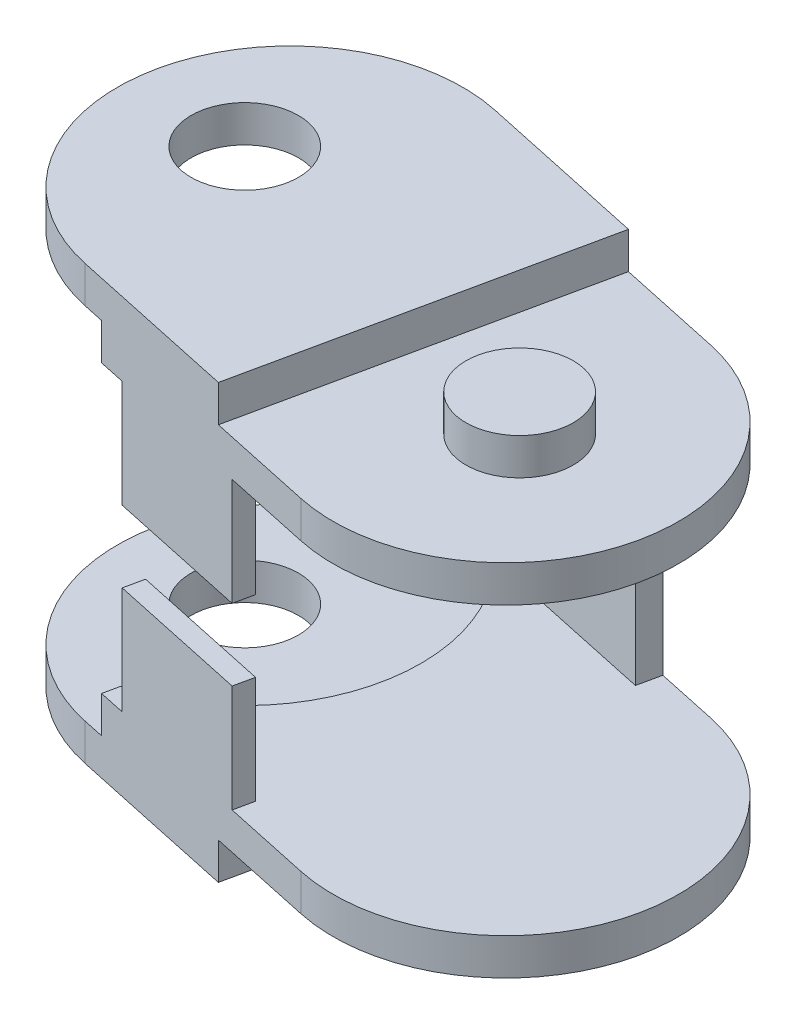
ISO-10303-21;
HEADER;
FILE_DESCRIPTION(('STEP AP214'),'2;1');
FILE_NAME('part.step','',(''),(''),'','','');
FILE_SCHEMA(('AUTOMOTIVE_DESIGN { 1 0 10303 214 1 1 1 1 }'));
ENDSEC;
DATA;
#1=APPLICATION_CONTEXT('core data for automotive mechanical design processes');
#2=APPLICATION_PROTOCOL_DEFINITION('international standard','automotive_design',2000,#1);
#3=PRODUCT_CONTEXT('',#1,'mechanical');
#4=PRODUCT('Part','Part','',(#3));
#5=PRODUCT_RELATED_PRODUCT_CATEGORY('part','',(#4));
#6=PRODUCT_DEFINITION_FORMATION('','',#4);
#7=PRODUCT_DEFINITION_CONTEXT('part definition',#1,'design');
#8=PRODUCT_DEFINITION('design','',#6,#7);
#9=PRODUCT_DEFINITION_SHAPE('','',#8);
#10=(LENGTH_UNIT() NAMED_UNIT(*) SI_UNIT(.MILLI.,.METRE.));
#11=(NAMED_UNIT(*) PLANE_ANGLE_UNIT() SI_UNIT($,.RADIAN.));
#12=(NAMED_UNIT(*) SI_UNIT($,.STERADIAN.) SOLID_ANGLE_UNIT());
#13=UNCERTAINTY_MEASURE_WITH_UNIT(LENGTH_MEASURE(1.E-05),#10,'distance_accuracy_value','');
#14=(GEOMETRIC_REPRESENTATION_CONTEXT(3) GLOBAL_UNCERTAINTY_ASSIGNED_CONTEXT((#13)) GLOBAL_UNIT_ASSIGNED_CONTEXT((#10,
#11,#12)) REPRESENTATION_CONTEXT('',''));
#15=CARTESIAN_POINT('',(0.,0.,0.));
#16=DIRECTION('',(0.,0.,1.));
#17=DIRECTION('',(1.,0.,0.));
#18=AXIS2_PLACEMENT_3D('',#15,#16,#17);
#19=CARTESIAN_POINT('',(-534.686032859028,6.,62.8004896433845));
#20=DIRECTION('',(0.,-1.,0.));
#21=DIRECTION('',(0.,0.,-1.));
#22=AXIS2_PLACEMENT_3D('',#19,#20,#21);
#23=PLANE('',#22);
#24=DIRECTION('',(0.977762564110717,0.,0.2097149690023));
#25=VECTOR('',#24,1.);
#26=CARTESIAN_POINT('',(-534.570689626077,6.,62.2627202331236));
#27=LINE('',#26,#25);
#28=CARTESIAN_POINT('',(-530.659639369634,6.,63.1015801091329));
#29=VERTEX_POINT('',#28);
#30=CARTESIAN_POINT('',(-538.48173988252,6.,61.4238603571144));
#31=VERTEX_POINT('',#30);
#32=EDGE_CURVE('E313',#29,#31,#27,.F.);
#33=ORIENTED_EDGE('',*,*,#32,.T.);
#34=DIRECTION('',(0.2097149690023,0.,-0.977762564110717));
#35=VECTOR('',#34,1.);
#36=CARTESIAN_POINT('',(-538.597083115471,6.,61.9616297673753));
#37=LINE('',#36,#35);
#38=CARTESIAN_POINT('',(-538.712426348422,6.,62.4993991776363));
#39=VERTEX_POINT('',#38);
#40=EDGE_CURVE('E291',#31,#39,#37,.F.);
#41=ORIENTED_EDGE('',*,*,#40,.T.);
#42=DIRECTION('',(0.977762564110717,0.,0.2097149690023));
#43=VECTOR('',#42,1.);
#44=CARTESIAN_POINT('',(-533.676949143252,6.,63.5794312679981));
#45=LINE('',#44,#43);
#46=CARTESIAN_POINT('',(-530.890325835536,6.,64.1771189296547));
#47=VERTEX_POINT('',#46);
#48=EDGE_CURVE('E238',#47,#39,#45,.F.);
#49=ORIENTED_EDGE('',*,*,#48,.F.);
#50=DIRECTION('',(-0.2097149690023,0.,0.977762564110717));
#51=VECTOR('',#50,1.);
#52=CARTESIAN_POINT('',(-530.774982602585,6.,63.6393495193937));
#53=LINE('',#52,#51);
#54=EDGE_CURVE('E262',#47,#29,#53,.F.);
#55=ORIENTED_EDGE('',*,*,#54,.T.);
#56=EDGE_LOOP('',(#33,#41,#49,#55));
#57=FACE_BOUND('',#56,.T.);
#58=ADVANCED_FACE('F17',(#57),#23,.F.);
#59=CARTESIAN_POINT('',(-538.597083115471,8.,61.9616297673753));
#60=DIRECTION('',(0.977762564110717,0.,0.2097149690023));
#61=DIRECTION('',(0.2097149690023,0.,-0.977762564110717));
#62=AXIS2_PLACEMENT_3D('',#59,#60,#61);
#63=PLANE('',#62);
#64=DIRECTION('',(0.,1.,0.));
#65=VECTOR('',#64,1.);
#66=CARTESIAN_POINT('',(-538.48173988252,8.,61.4238603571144));
#67=LINE('',#66,#65);
#68=CARTESIAN_POINT('',(-538.48173988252,0.,61.4238603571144));
#69=VERTEX_POINT('',#68);
#70=EDGE_CURVE('E314',#31,#69,#67,.F.);
#71=ORIENTED_EDGE('',*,*,#70,.T.);
#72=DIRECTION('',(0.2097149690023,0.,-0.977762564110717));
#73=VECTOR('',#72,1.);
#74=CARTESIAN_POINT('',(-538.597083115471,0.,61.9616297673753));
#75=LINE('',#74,#73);
#76=CARTESIAN_POINT('',(-538.712426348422,0.,62.4993991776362));
#77=VERTEX_POINT('',#76);
#78=EDGE_CURVE('E301',#77,#69,#75,.T.);
#79=ORIENTED_EDGE('',*,*,#78,.F.);
#80=DIRECTION('',(0.,1.,0.));
#81=VECTOR('',#80,1.);
#82=CARTESIAN_POINT('',(-538.712426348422,20.1,62.4993991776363));
#83=LINE('',#82,#81);
#84=EDGE_CURVE('E282',#39,#77,#83,.F.);
#85=ORIENTED_EDGE('',*,*,#84,.F.);
#86=ORIENTED_EDGE('',*,*,#40,.F.);
#87=EDGE_LOOP('',(#71,#79,#85,#86));
#88=FACE_BOUND('',#87,.T.);
#89=ADVANCED_FACE('F925',(#88),#63,.F.);
#90=CARTESIAN_POINT('',(-538.155320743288,8.,52.7494179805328));
#91=DIRECTION('',(-0.977762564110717,0.,-0.2097149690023));
#92=DIRECTION('',(-0.2097149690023,0.,0.977762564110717));
#93=AXIS2_PLACEMENT_3D('',#90,#91,#92);
#94=PLANE('',#93);
#95=DIRECTION('',(0.,1.,0.));
#96=VECTOR('',#95,1.);
#97=CARTESIAN_POINT('',(-540.179070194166,20.1,62.1848267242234));
#98=LINE('',#97,#96);
#99=CARTESIAN_POINT('',(-540.179070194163,0.,62.1848267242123));
#100=VERTEX_POINT('',#99);
#101=CARTESIAN_POINT('',(-540.179070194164,-2.05,62.184826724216));
#102=VERTEX_POINT('',#101);
#103=EDGE_CURVE('E269',#100,#102,#98,.F.);
#104=ORIENTED_EDGE('',*,*,#103,.F.);
#105=DIRECTION('',(-0.2097149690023,0.,0.977762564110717));
#106=VECTOR('',#105,1.);
#107=CARTESIAN_POINT('',(-538.155320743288,0.,52.7494179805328));
#108=LINE('',#107,#106);
#109=CARTESIAN_POINT('',(-539.992841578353,0.,61.316565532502));
#110=VERTEX_POINT('',#109);
#111=EDGE_CURVE('E274',#100,#110,#108,.F.);
#112=ORIENTED_EDGE('',*,*,#111,.T.);
#113=DIRECTION('',(0.,-1.,0.));
#114=VECTOR('',#113,1.);
#115=CARTESIAN_POINT('',(-539.992841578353,-1.025,61.3165655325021));
#116=LINE('',#115,#114);
#117=CARTESIAN_POINT('',(-539.992841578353,-2.05,61.3165655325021));
#118=VERTEX_POINT('',#117);
#119=EDGE_CURVE('E239',#110,#118,#116,.T.);
#120=ORIENTED_EDGE('',*,*,#119,.T.);
#121=DIRECTION('',(-0.20971496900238,0.,0.9777625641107));
#122=VECTOR('',#121,1.);
#123=CARTESIAN_POINT('',(-539.992841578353,-2.05,61.3165655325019));
#124=LINE('',#123,#122);
#125=EDGE_CURVE('E227',#118,#102,#124,.T.);
#126=ORIENTED_EDGE('',*,*,#125,.T.);
#127=EDGE_LOOP('',(#104,#112,#120,#126));
#128=FACE_BOUND('',#127,.T.);
#129=ADVANCED_FACE('F916',(#128),#94,.T.);
#130=CARTESIAN_POINT('',(-530.774982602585,8.,63.6393495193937));
#131=DIRECTION('',(-0.977762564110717,0.,-0.2097149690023));
#132=DIRECTION('',(-0.2097149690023,0.,0.977762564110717));
#133=AXIS2_PLACEMENT_3D('',#130,#131,#132);
#134=PLANE('',#133);
#135=DIRECTION('',(0.,1.,0.));
#136=VECTOR('',#135,1.);
#137=CARTESIAN_POINT('',(-530.890325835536,20.1,64.1771189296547));
#138=LINE('',#137,#136);
#139=CARTESIAN_POINT('',(-530.890325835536,0.,64.1771189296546));
#140=VERTEX_POINT('',#139);
#141=EDGE_CURVE('E268',#140,#47,#138,.T.);
#142=ORIENTED_EDGE('',*,*,#141,.F.);
#143=DIRECTION('',(-0.2097149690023,0.,0.977762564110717));
#144=VECTOR('',#143,1.);
#145=CARTESIAN_POINT('',(-530.774982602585,0.,63.6393495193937));
#146=LINE('',#145,#144);
#147=CARTESIAN_POINT('',(-530.659639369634,0.,63.1015801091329));
#148=VERTEX_POINT('',#147);
#149=EDGE_CURVE('E272',#148,#140,#146,.T.);
#150=ORIENTED_EDGE('',*,*,#149,.F.);
#151=DIRECTION('',(0.,1.,0.));
#152=VECTOR('',#151,1.);
#153=CARTESIAN_POINT('',(-530.659639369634,8.,63.1015801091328));
#154=LINE('',#153,#152);
#155=EDGE_CURVE('E310',#148,#29,#154,.T.);
#156=ORIENTED_EDGE('',*,*,#155,.T.);
#157=ORIENTED_EDGE('',*,*,#54,.F.);
#158=EDGE_LOOP('',(#142,#150,#156,#157));
#159=FACE_BOUND('',#158,.T.);
#160=ADVANCED_FACE('F907',(#159),#134,.F.);
#161=CARTESIAN_POINT('',(-523.000001,-4.1,56.));
#162=DIRECTION('',(0.,-1.,0.));
#163=DIRECTION('',(0.,0.,-1.));
#164=AXIS2_PLACEMENT_3D('',#161,#162,#163);
#165=PLANE('',#164);
#166=CARTESIAN_POINT('',(-523.000001,-4.1,56.));
#167=DIRECTION('',(0.,-1.,0.));
#168=DIRECTION('',(0.,0.,-1.));
#169=AXIS2_PLACEMENT_3D('',#166,#167,#168);
#170=CIRCLE('',#169,2.99999999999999);
#171=CARTESIAN_POINT('',(-523.000001,-4.1,53.));
#172=VERTEX_POINT('',#171);
#173=EDGE_CURVE('E395',#172,#172,#170,.F.);
#174=ORIENTED_EDGE('',*,*,#173,.F.);
#175=EDGE_LOOP('',(#174));
#176=FACE_BOUND('',#175,.T.);
#177=ADVANCED_FACE('F898',(#176),#165,.T.);
#178=CARTESIAN_POINT('',(-523.000001,20.1,56.));
#179=DIRECTION('',(0.,1.,0.));
#180=DIRECTION('',(0.,0.,1.));
#181=AXIS2_PLACEMENT_3D('',#178,#179,#180);
#182=PLANE('',#181);
#183=CARTESIAN_POINT('',(-523.000001,20.1,56.));
#184=DIRECTION('',(0.,-1.,0.));
#185=DIRECTION('',(0.,0.,-1.));
#186=AXIS2_PLACEMENT_3D('',#183,#184,#185);
#187=CIRCLE('',#186,2.99999999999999);
#188=CARTESIAN_POINT('',(-523.000001,20.1,53.));
#189=VERTEX_POINT('',#188);
#190=EDGE_CURVE('E391',#189,#189,#187,.T.);
#191=ORIENTED_EDGE('',*,*,#190,.F.);
#192=EDGE_LOOP('',(#191));
#193=FACE_BOUND('',#192,.T.);
#194=ADVANCED_FACE('F889',(#193),#182,.T.);
#195=CARTESIAN_POINT('',(-542.555252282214,-3.075,51.805700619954));
#196=DIRECTION('',(0.,-1.,0.));
#197=DIRECTION('',(0.,0.,-1.));
#198=AXIS2_PLACEMENT_3D('',#195,#196,#197);
#199=CYLINDRICAL_SURFACE('',#198,2.99999999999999);
#200=CARTESIAN_POINT('',(-542.555252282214,-4.1,51.805700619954));
#201=DIRECTION('',(0.,-1.,0.));
#202=DIRECTION('',(0.,0.,-1.));
#203=AXIS2_PLACEMENT_3D('',#200,#201,#202);
#204=CIRCLE('',#203,2.99999999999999);
#205=CARTESIAN_POINT('',(-542.555252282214,-4.1,48.805700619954));
#206=VERTEX_POINT('',#205);
#207=EDGE_CURVE('E381',#206,#206,#204,.F.);
#208=ORIENTED_EDGE('',*,*,#207,.F.);
#209=EDGE_LOOP('',(#208));
#210=FACE_BOUND('',#209,.T.);
#211=CARTESIAN_POINT('',(-542.555252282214,-2.05,51.805700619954));
#212=DIRECTION('',(0.,-1.,0.));
#213=DIRECTION('',(0.,0.,-1.));
#214=AXIS2_PLACEMENT_3D('',#211,#212,#213);
#215=CIRCLE('',#214,2.99999999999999);
#216=CARTESIAN_POINT('',(-542.555252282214,-2.05,48.805700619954));
#217=VERTEX_POINT('',#216);
#218=EDGE_CURVE('E20',#217,#217,#215,.F.);
#219=ORIENTED_EDGE('',*,*,#218,.T.);
#220=EDGE_LOOP('',(#219));
#221=FACE_BOUND('',#220,.T.);
#222=ADVANCED_FACE('F880',(#210,#221),#199,.F.);
#223=CARTESIAN_POINT('',(-547.932946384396,-2.05,50.6522682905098));
#224=DIRECTION('',(0.,-1.,0.));
#225=DIRECTION('',(0.,0.,-1.));
#226=AXIS2_PLACEMENT_3D('',#223,#224,#225);
#227=PLANE('',#226);
#228=ORIENTED_EDGE('',*,*,#218,.F.);
#229=EDGE_LOOP('',(#228));
#230=FACE_BOUND('',#229,.T.);
#231=DIRECTION('',(0.977762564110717,0.,0.2097149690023));
#232=VECTOR('',#231,1.);
#233=CARTESIAN_POINT('',(-533.676949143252,-2.05,63.5794312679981));
#234=LINE('',#233,#232);
#235=CARTESIAN_POINT('',(-541.352385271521,-2.05,61.93316876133));
#236=VERTEX_POINT('',#235);
#237=EDGE_CURVE('E265',#102,#236,#234,.F.);
#238=ORIENTED_EDGE('',*,*,#237,.F.);
#239=ORIENTED_EDGE('',*,*,#125,.F.);
#240=CARTESIAN_POINT('',(-542.555252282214,-2.05,51.805700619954));
#241=DIRECTION('',(0.,-1.,0.));
#242=DIRECTION('',(0.,0.,-1.));
#243=AXIS2_PLACEMENT_3D('',#240,#241,#242);
#244=CIRCLE('',#243,9.84999999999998);
#245=CARTESIAN_POINT('',(-536.317799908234,-2.05,44.182270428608));
#246=VERTEX_POINT('',#245);
#247=EDGE_CURVE('E232',#118,#246,#244,.F.);
#248=ORIENTED_EDGE('',*,*,#247,.T.);
#249=DIRECTION('',(-0.209714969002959,0.,0.977762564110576));
#250=VECTOR('',#249,1.);
#251=CARTESIAN_POINT('',(-536.131571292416,-2.05,43.3140092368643));
#252=LINE('',#251,#250);
#253=CARTESIAN_POINT('',(-536.131571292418,-2.05,43.3140092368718));
#254=VERTEX_POINT('',#253);
#255=EDGE_CURVE('E217',#254,#246,#252,.T.);
#256=ORIENTED_EDGE('',*,*,#255,.F.);
#257=DIRECTION('',(0.977762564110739,0.,0.209714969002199));
#258=VECTOR('',#257,1.);
#259=CARTESIAN_POINT('',(-537.304886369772,-2.05,43.0623512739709));
#260=LINE('',#259,#258);
#261=CARTESIAN_POINT('',(-537.304886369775,-2.05,43.0623512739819));
#262=VERTEX_POINT('',#261);
#263=EDGE_CURVE('E228',#262,#254,#260,.T.);
#264=ORIENTED_EDGE('',*,*,#263,.F.);
#265=CARTESIAN_POINT('',(-539.328635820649,-2.05,52.4977600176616));
#266=DIRECTION('',(0.,-1.,0.));
#267=DIRECTION('',(0.,0.,-1.));
#268=AXIS2_PLACEMENT_3D('',#265,#266,#267);
#269=CIRCLE('',#268,9.65000000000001);
#270=EDGE_CURVE('E378',#236,#262,#269,.T.);
#271=ORIENTED_EDGE('',*,*,#270,.F.);
#272=EDGE_LOOP('',(#238,#239,#248,#256,#264,#271));
#273=FACE_BOUND('',#272,.T.);
#274=ADVANCED_FACE('F234',(#230,#273),#227,.F.);
#275=CARTESIAN_POINT('',(-534.570689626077,8.,62.2627202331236));
#276=DIRECTION('',(-0.2097149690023,0.,0.977762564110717));
#277=DIRECTION('',(0.977762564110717,0.,0.2097149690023));
#278=AXIS2_PLACEMENT_3D('',#275,#276,#277);
#279=PLANE('',#278);
#280=ORIENTED_EDGE('',*,*,#155,.F.);
#281=DIRECTION('',(-0.977762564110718,0.,-0.209714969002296));
#282=VECTOR('',#281,1.);
#283=CARTESIAN_POINT('',(-530.659639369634,0.,63.1015801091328));
#284=LINE('',#283,#282);
#285=EDGE_CURVE('E298',#148,#69,#284,.T.);
#286=ORIENTED_EDGE('',*,*,#285,.T.);
#287=ORIENTED_EDGE('',*,*,#70,.F.);
#288=ORIENTED_EDGE('',*,*,#32,.F.);
#289=EDGE_LOOP('',(#280,#286,#287,#288));
#290=FACE_BOUND('',#289,.T.);
#291=ADVANCED_FACE('F864',(#290),#279,.F.);
#292=CARTESIAN_POINT('',(-542.555252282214,-1.025,51.805700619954));
#293=DIRECTION('',(0.,-1.,0.));
#294=DIRECTION('',(0.,0.,-1.));
#295=AXIS2_PLACEMENT_3D('',#292,#293,#294);
#296=CYLINDRICAL_SURFACE('',#295,9.84999999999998);
#297=CARTESIAN_POINT('',(-542.555252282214,0.,51.805700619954));
#298=DIRECTION('',(0.,-1.,0.));
#299=DIRECTION('',(0.,0.,-1.));
#300=AXIS2_PLACEMENT_3D('',#297,#298,#299);
#301=CIRCLE('',#300,9.84999999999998);
#302=CARTESIAN_POINT('',(-535.708127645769,0.,44.7247837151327));
#303=VERTEX_POINT('',#302);
#304=EDGE_CURVE('E297',#110,#303,#301,.F.);
#305=ORIENTED_EDGE('',*,*,#304,.T.);
#306=CARTESIAN_POINT('',(-542.555252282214,0.,51.805700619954));
#307=DIRECTION('',(0.,-1.,0.));
#308=DIRECTION('',(0.,0.,-1.));
#309=AXIS2_PLACEMENT_3D('',#306,#307,#308);
#310=CIRCLE('',#309,9.84999999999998);
#311=CARTESIAN_POINT('',(-536.317799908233,0.,44.1822704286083));
#312=VERTEX_POINT('',#311);
#313=EDGE_CURVE('E242',#303,#312,#310,.F.);
#314=ORIENTED_EDGE('',*,*,#313,.T.);
#315=DIRECTION('',(0.,1.,0.));
#316=VECTOR('',#315,1.);
#317=CARTESIAN_POINT('',(-536.317799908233,8.,44.1822704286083));
#318=LINE('',#317,#316);
#319=EDGE_CURVE('E222',#246,#312,#318,.T.);
#320=ORIENTED_EDGE('',*,*,#319,.F.);
#321=ORIENTED_EDGE('',*,*,#247,.F.);
#322=ORIENTED_EDGE('',*,*,#119,.F.);
#323=EDGE_LOOP('',(#305,#314,#320,#321,#322));
#324=FACE_BOUND('',#323,.T.);
#325=ADVANCED_FACE('F240',(#324),#296,.F.);
#326=CARTESIAN_POINT('',(-533.676949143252,20.1,63.5794312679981));
#327=DIRECTION('',(-0.2097149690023,0.,0.977762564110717));
#328=DIRECTION('',(0.977762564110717,0.,0.2097149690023));
#329=AXIS2_PLACEMENT_3D('',#326,#327,#328);
#330=PLANE('',#329);
#331=DIRECTION('',(-0.977762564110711,0.,-0.209714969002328));
#332=VECTOR('',#331,1.);
#333=CARTESIAN_POINT('',(-526.001513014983,0.,65.2256937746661));
#334=LINE('',#333,#332);
#335=CARTESIAN_POINT('',(-526.001513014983,0.,65.2256937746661));
#336=VERTEX_POINT('',#335);
#337=EDGE_CURVE('E323',#336,#140,#334,.T.);
#338=ORIENTED_EDGE('',*,*,#337,.T.);
#339=ORIENTED_EDGE('',*,*,#141,.T.);
#340=ORIENTED_EDGE('',*,*,#48,.T.);
#341=ORIENTED_EDGE('',*,*,#84,.T.);
#342=DIRECTION('',(-0.977762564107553,0.,-0.209714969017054));
#343=VECTOR('',#342,1.);
#344=CARTESIAN_POINT('',(-538.712426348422,0.,62.4993991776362));
#345=LINE('',#344,#343);
#346=EDGE_CURVE('E294',#77,#100,#345,.T.);
#347=ORIENTED_EDGE('',*,*,#346,.T.);
#348=ORIENTED_EDGE('',*,*,#103,.T.);
#349=ORIENTED_EDGE('',*,*,#237,.T.);
#350=DIRECTION('',(0.,-1.,0.));
#351=VECTOR('',#350,1.);
#352=CARTESIAN_POINT('',(-541.352385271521,20.1,61.93316876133));
#353=LINE('',#352,#351);
#354=CARTESIAN_POINT('',(-541.35238527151,-4.1,61.9331687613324));
#355=VERTEX_POINT('',#354);
#356=EDGE_CURVE('E245',#355,#236,#353,.F.);
#357=ORIENTED_EDGE('',*,*,#356,.F.);
#358=DIRECTION('',(-0.977762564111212,0.,-0.209714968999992));
#359=VECTOR('',#358,1.);
#360=CARTESIAN_POINT('',(-531.868088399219,-4.1,63.9674039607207));
#361=LINE('',#360,#359);
#362=CARTESIAN_POINT('',(-531.868088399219,-4.1,63.9674039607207));
#363=VERTEX_POINT('',#362);
#364=EDGE_CURVE('E384',#363,#355,#361,.T.);
#365=ORIENTED_EDGE('',*,*,#364,.F.);
#366=DIRECTION('',(0.,1.,0.));
#367=VECTOR('',#366,1.);
#368=CARTESIAN_POINT('',(-531.868088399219,-3.075,63.9674039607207));
#369=LINE('',#368,#367);
#370=CARTESIAN_POINT('',(-531.868088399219,-2.05,63.9674039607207));
#371=VERTEX_POINT('',#370);
#372=EDGE_CURVE('E386',#371,#363,#369,.F.);
#373=ORIENTED_EDGE('',*,*,#372,.F.);
#374=DIRECTION('',(-0.977762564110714,0.,-0.209714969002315));
#375=VECTOR('',#374,1.);
#376=CARTESIAN_POINT('',(-526.001513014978,-2.05,65.2256937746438));
#377=LINE('',#376,#375);
#378=CARTESIAN_POINT('',(-526.001513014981,-2.05,65.2256937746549));
#379=VERTEX_POINT('',#378);
#380=EDGE_CURVE('E370',#379,#371,#377,.T.);
#381=ORIENTED_EDGE('',*,*,#380,.F.);
#382=DIRECTION('',(0.,-1.,0.));
#383=VECTOR('',#382,1.);
#384=CARTESIAN_POINT('',(-526.001513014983,20.1,65.2256937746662));
#385=LINE('',#384,#383);
#386=EDGE_CURVE('E371',#336,#379,#385,.T.);
#387=ORIENTED_EDGE('',*,*,#386,.F.);
#388=EDGE_LOOP('',(#338,#339,#340,#341,#347,#348,#349,#357,#365,#373,#381,#387));
#389=FACE_BOUND('',#388,.T.);
#390=ADVANCED_FACE('F510',(#389),#330,.T.);
#391=CARTESIAN_POINT('',(-523.000001,-3.075,56.));
#392=DIRECTION('',(0.,-1.,0.));
#393=DIRECTION('',(0.,0.,-1.));
#394=AXIS2_PLACEMENT_3D('',#391,#392,#393);
#395=CYLINDRICAL_SURFACE('',#394,2.99999999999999);
#396=CARTESIAN_POINT('',(-523.000001,-2.05,56.));
#397=DIRECTION('',(0.,-1.,0.));
#398=DIRECTION('',(0.,0.,-1.));
#399=AXIS2_PLACEMENT_3D('',#396,#397,#398);
#400=CIRCLE('',#399,2.99999999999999);
#401=CARTESIAN_POINT('',(-523.000001,-2.05,53.));
#402=VERTEX_POINT('',#401);
#403=EDGE_CURVE('E363',#402,#402,#400,.F.);
#404=ORIENTED_EDGE('',*,*,#403,.F.);
#405=EDGE_LOOP('',(#404));
#406=FACE_BOUND('',#405,.T.);
#407=ORIENTED_EDGE('',*,*,#173,.T.);
#408=EDGE_LOOP('',(#407));
#409=FACE_BOUND('',#408,.T.);
#410=ADVANCED_FACE('F840',(#406,#409),#395,.T.);
#411=CARTESIAN_POINT('',(-523.000001,19.075,56.));
#412=DIRECTION('',(0.,-1.,0.));
#413=DIRECTION('',(0.,0.,-1.));
#414=AXIS2_PLACEMENT_3D('',#411,#412,#413);
#415=CYLINDRICAL_SURFACE('',#414,2.99999999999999);
#416=ORIENTED_EDGE('',*,*,#190,.T.);
#417=EDGE_LOOP('',(#416));
#418=FACE_BOUND('',#417,.T.);
#419=CARTESIAN_POINT('',(-523.000001,18.05,56.));
#420=DIRECTION('',(0.,-1.,0.));
#421=DIRECTION('',(0.,0.,-1.));
#422=AXIS2_PLACEMENT_3D('',#419,#420,#421);
#423=CIRCLE('',#422,2.99999999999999);
#424=CARTESIAN_POINT('',(-523.000001,18.05,53.));
#425=VERTEX_POINT('',#424);
#426=EDGE_CURVE('E359',#425,#425,#423,.F.);
#427=ORIENTED_EDGE('',*,*,#426,.T.);
#428=EDGE_LOOP('',(#427));
#429=FACE_BOUND('',#428,.T.);
#430=ADVANCED_FACE('F831',(#418,#429),#415,.T.);
#431=CARTESIAN_POINT('',(-542.555252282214,19.075,51.805700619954));
#432=DIRECTION('',(0.,-1.,0.));
#433=DIRECTION('',(0.,0.,-1.));
#434=AXIS2_PLACEMENT_3D('',#431,#432,#433);
#435=CYLINDRICAL_SURFACE('',#434,2.99999999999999);
#436=CARTESIAN_POINT('',(-542.555252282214,18.05,51.805700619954));
#437=DIRECTION('',(0.,-1.,0.));
#438=DIRECTION('',(0.,0.,-1.));
#439=AXIS2_PLACEMENT_3D('',#436,#437,#438);
#440=CIRCLE('',#439,2.99999999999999);
#441=CARTESIAN_POINT('',(-542.555252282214,18.05,48.805700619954));
#442=VERTEX_POINT('',#441);
#443=EDGE_CURVE('E387',#442,#442,#440,.F.);
#444=ORIENTED_EDGE('',*,*,#443,.F.);
#445=EDGE_LOOP('',(#444));
#446=FACE_BOUND('',#445,.T.);
#447=CARTESIAN_POINT('',(-542.555252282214,20.1,51.805700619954));
#448=DIRECTION('',(0.,-1.,0.));
#449=DIRECTION('',(0.,0.,-1.));
#450=AXIS2_PLACEMENT_3D('',#447,#448,#449);
#451=CIRCLE('',#450,2.99999999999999);
#452=CARTESIAN_POINT('',(-542.555252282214,20.1,48.805700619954));
#453=VERTEX_POINT('',#452);
#454=EDGE_CURVE('E355',#453,#453,#451,.F.);
#455=ORIENTED_EDGE('',*,*,#454,.T.);
#456=EDGE_LOOP('',(#455));
#457=FACE_BOUND('',#456,.T.);
#458=ADVANCED_FACE('F822',(#446,#457),#435,.F.);
#459=CARTESIAN_POINT('',(-547.932946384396,18.05,50.6522682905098));
#460=DIRECTION('',(0.,-1.,0.));
#461=DIRECTION('',(0.,0.,-1.));
#462=AXIS2_PLACEMENT_3D('',#459,#460,#461);
#463=PLANE('',#462);
#464=ORIENTED_EDGE('',*,*,#443,.T.);
#465=EDGE_LOOP('',(#464));
#466=FACE_BOUND('',#465,.T.);
#467=DIRECTION('',(-0.2097149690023,0.,0.977762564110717));
#468=VECTOR('',#467,1.);
#469=CARTESIAN_POINT('',(-538.155320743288,18.05,52.7494179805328));
#470=LINE('',#469,#468);
#471=CARTESIAN_POINT('',(-540.179070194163,18.05,62.1848267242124));
#472=VERTEX_POINT('',#471);
#473=CARTESIAN_POINT('',(-539.992841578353,18.05,61.316565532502));
#474=VERTEX_POINT('',#473);
#475=EDGE_CURVE('E466',#472,#474,#470,.F.);
#476=ORIENTED_EDGE('',*,*,#475,.F.);
#477=DIRECTION('',(-0.977762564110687,0.,-0.209714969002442));
#478=VECTOR('',#477,1.);
#479=CARTESIAN_POINT('',(-540.179070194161,18.05,62.1848267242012));
#480=LINE('',#479,#478);
#481=CARTESIAN_POINT('',(-541.352385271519,18.05,61.9331687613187));
#482=VERTEX_POINT('',#481);
#483=EDGE_CURVE('E390',#472,#482,#480,.T.);
#484=ORIENTED_EDGE('',*,*,#483,.T.);
#485=CARTESIAN_POINT('',(-539.328635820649,18.05,52.4977600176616));
#486=DIRECTION('',(0.,-1.,0.));
#487=DIRECTION('',(0.,0.,-1.));
#488=AXIS2_PLACEMENT_3D('',#485,#486,#487);
#489=CIRCLE('',#488,9.65000000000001);
#490=CARTESIAN_POINT('',(-537.304886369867,18.05,43.0623512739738));
#491=VERTEX_POINT('',#490);
#492=EDGE_CURVE('E352',#491,#482,#489,.F.);
#493=ORIENTED_EDGE('',*,*,#492,.F.);
#494=DIRECTION('',(0.977762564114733,0.,0.209714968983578));
#495=VECTOR('',#494,1.);
#496=CARTESIAN_POINT('',(-537.304886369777,18.05,43.0623512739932));
#497=LINE('',#496,#495);
#498=CARTESIAN_POINT('',(-536.131571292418,18.05,43.3140092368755));
#499=VERTEX_POINT('',#498);
#500=EDGE_CURVE('E394',#491,#499,#497,.T.);
#501=ORIENTED_EDGE('',*,*,#500,.T.);
#502=DIRECTION('',(-0.2097149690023,0.,0.977762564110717));
#503=VECTOR('',#502,1.);
#504=CARTESIAN_POINT('',(-538.155320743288,18.05,52.7494179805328));
#505=LINE('',#504,#503);
#506=CARTESIAN_POINT('',(-536.317799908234,18.05,44.182270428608));
#507=VERTEX_POINT('',#506);
#508=EDGE_CURVE('E445',#507,#499,#505,.F.);
#509=ORIENTED_EDGE('',*,*,#508,.F.);
#510=CARTESIAN_POINT('',(-542.555252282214,18.05,51.805700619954));
#511=DIRECTION('',(0.,-1.,0.));
#512=DIRECTION('',(0.,0.,-1.));
#513=AXIS2_PLACEMENT_3D('',#510,#511,#512);
#514=CIRCLE('',#513,9.84999999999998);
#515=EDGE_CURVE('E342',#507,#474,#514,.T.);
#516=ORIENTED_EDGE('',*,*,#515,.T.);
#517=EDGE_LOOP('',(#476,#484,#493,#501,#509,#516));
#518=FACE_BOUND('',#517,.T.);
#519=ADVANCED_FACE('F813',(#466,#518),#463,.T.);
#520=CARTESIAN_POINT('',(-542.555252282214,0.,51.805700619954));
#521=DIRECTION('',(0.,1.,0.));
#522=DIRECTION('',(0.,0.,1.));
#523=AXIS2_PLACEMENT_3D('',#520,#521,#522);
#524=PLANE('',#523);
#525=ORIENTED_EDGE('',*,*,#313,.F.);
#526=DIRECTION('',(-0.977762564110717,0.,-0.2097149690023));
#527=VECTOR('',#526,1.);
#528=CARTESIAN_POINT('',(-531.024535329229,0.,45.7293419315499));
#529=LINE('',#528,#527);
#530=CARTESIAN_POINT('',(-536.402229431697,0.,44.5759096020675));
#531=VERTEX_POINT('',#530);
#532=EDGE_CURVE('E434',#303,#531,#529,.T.);
#533=ORIENTED_EDGE('',*,*,#532,.T.);
#534=DIRECTION('',(-0.2097149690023,0.,0.977762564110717));
#535=VECTOR('',#534,1.);
#536=CARTESIAN_POINT('',(-538.155320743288,0.,52.7494179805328));
#537=LINE('',#536,#535);
#538=EDGE_CURVE('E244',#312,#531,#537,.T.);
#539=ORIENTED_EDGE('',*,*,#538,.F.);
#540=EDGE_LOOP('',(#525,#533,#539));
#541=FACE_BOUND('',#540,.T.);
#542=ADVANCED_FACE('F581',(#541),#524,.F.);
#543=CARTESIAN_POINT('',(-542.555252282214,16.,51.805700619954));
#544=DIRECTION('',(0.,-1.,0.));
#545=DIRECTION('',(0.,0.,-1.));
#546=AXIS2_PLACEMENT_3D('',#543,#544,#545);
#547=PLANE('',#546);
#548=CARTESIAN_POINT('',(-542.555252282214,16.,51.805700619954));
#549=DIRECTION('',(0.,-1.,0.));
#550=DIRECTION('',(0.,0.,-1.));
#551=AXIS2_PLACEMENT_3D('',#548,#549,#550);
#552=CIRCLE('',#551,9.84999999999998);
#553=CARTESIAN_POINT('',(-535.708127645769,16.,44.7247837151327));
#554=VERTEX_POINT('',#553);
#555=CARTESIAN_POINT('',(-536.317799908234,16.,44.182270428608));
#556=VERTEX_POINT('',#555);
#557=EDGE_CURVE('E346',#554,#556,#552,.F.);
#558=ORIENTED_EDGE('',*,*,#557,.T.);
#559=DIRECTION('',(-0.2097149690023,0.,0.977762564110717));
#560=VECTOR('',#559,1.);
#561=CARTESIAN_POINT('',(-538.155320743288,16.,52.7494179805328));
#562=LINE('',#561,#560);
#563=CARTESIAN_POINT('',(-536.402229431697,16.,44.5759096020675));
#564=VERTEX_POINT('',#563);
#565=EDGE_CURVE('E247',#564,#556,#562,.F.);
#566=ORIENTED_EDGE('',*,*,#565,.F.);
#567=DIRECTION('',(-0.977762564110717,0.,-0.2097149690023));
#568=VECTOR('',#567,1.);
#569=CARTESIAN_POINT('',(-531.024535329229,16.,45.7293419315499));
#570=LINE('',#569,#568);
#571=EDGE_CURVE('E440',#564,#554,#570,.F.);
#572=ORIENTED_EDGE('',*,*,#571,.T.);
#573=EDGE_LOOP('',(#558,#566,#572));
#574=FACE_BOUND('',#573,.T.);
#575=ADVANCED_FACE('F572',(#574),#547,.F.);
#576=CARTESIAN_POINT('',(-529.844338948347,-3.075,54.5319952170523));
#577=DIRECTION('',(0.977762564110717,0.,0.2097149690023));
#578=DIRECTION('',(0.2097149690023,0.,-0.977762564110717));
#579=AXIS2_PLACEMENT_3D('',#576,#577,#578);
#580=PLANE('',#579);
#581=DIRECTION('',(0.,1.,0.));
#582=VECTOR('',#581,1.);
#583=CARTESIAN_POINT('',(-527.82058949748,20.1,45.0965864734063));
#584=LINE('',#583,#582);
#585=CARTESIAN_POINT('',(-527.82058949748,-2.05,45.0965864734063));
#586=VERTEX_POINT('',#585);
#587=CARTESIAN_POINT('',(-527.82058949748,-4.1,45.0965864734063));
#588=VERTEX_POINT('',#587);
#589=EDGE_CURVE('E419',#586,#588,#584,.F.);
#590=ORIENTED_EDGE('',*,*,#589,.F.);
#591=DIRECTION('',(0.209714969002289,0.,-0.977762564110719));
#592=VECTOR('',#591,1.);
#593=CARTESIAN_POINT('',(-531.868088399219,-2.05,63.9674039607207));
#594=LINE('',#593,#592);
#595=EDGE_CURVE('E366',#371,#586,#594,.T.);
#596=ORIENTED_EDGE('',*,*,#595,.F.);
#597=ORIENTED_EDGE('',*,*,#372,.T.);
#598=DIRECTION('',(-0.209714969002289,0.,0.977762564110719));
#599=VECTOR('',#598,1.);
#600=CARTESIAN_POINT('',(-527.820589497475,-4.1,45.0965864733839));
#601=LINE('',#600,#599);
#602=EDGE_CURVE('E427',#588,#363,#601,.T.);
#603=ORIENTED_EDGE('',*,*,#602,.F.);
#604=EDGE_LOOP('',(#590,#596,#597,#603));
#605=FACE_BOUND('',#604,.T.);
#606=ADVANCED_FACE('F570',(#605),#580,.T.);
#607=CARTESIAN_POINT('',(-531.65319969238,-4.1,54.1440225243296));
#608=DIRECTION('',(0.,-1.,0.));
#609=DIRECTION('',(0.,0.,-1.));
#610=AXIS2_PLACEMENT_3D('',#607,#608,#609);
#611=PLANE('',#610);
#612=ORIENTED_EDGE('',*,*,#207,.T.);
#613=EDGE_LOOP('',(#612));
#614=FACE_BOUND('',#613,.T.);
#615=CARTESIAN_POINT('',(-539.328635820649,-4.1,52.4977600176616));
#616=DIRECTION('',(0.,-1.,0.));
#617=DIRECTION('',(0.,0.,-1.));
#618=AXIS2_PLACEMENT_3D('',#615,#616,#617);
#619=CIRCLE('',#618,9.65000000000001);
#620=CARTESIAN_POINT('',(-537.304886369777,-4.1,43.0623512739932));
#621=VERTEX_POINT('',#620);
#622=EDGE_CURVE('E250',#621,#355,#619,.F.);
#623=ORIENTED_EDGE('',*,*,#622,.F.);
#624=DIRECTION('',(-0.977762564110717,0.,-0.2097149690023));
#625=VECTOR('',#624,1.);
#626=CARTESIAN_POINT('',(-529.629450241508,-4.1,44.7086137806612));
#627=LINE('',#626,#625);
#628=EDGE_CURVE('E415',#588,#621,#627,.T.);
#629=ORIENTED_EDGE('',*,*,#628,.F.);
#630=ORIENTED_EDGE('',*,*,#602,.T.);
#631=ORIENTED_EDGE('',*,*,#364,.T.);
#632=EDGE_LOOP('',(#623,#629,#630,#631));
#633=FACE_BOUND('',#632,.T.);
#634=ADVANCED_FACE('F565',(#614,#633),#611,.T.);
#635=CARTESIAN_POINT('',(-539.328635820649,20.1,52.4977600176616));
#636=DIRECTION('',(0.,-1.,0.));
#637=DIRECTION('',(0.,0.,-1.));
#638=AXIS2_PLACEMENT_3D('',#635,#636,#637);
#639=CYLINDRICAL_SURFACE('',#638,9.65000000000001);
#640=ORIENTED_EDGE('',*,*,#622,.T.);
#641=ORIENTED_EDGE('',*,*,#356,.T.);
#642=ORIENTED_EDGE('',*,*,#270,.T.);
#643=DIRECTION('',(0.,1.,0.));
#644=VECTOR('',#643,1.);
#645=CARTESIAN_POINT('',(-537.304886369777,20.1,43.0623512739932));
#646=LINE('',#645,#644);
#647=EDGE_CURVE('E409',#621,#262,#646,.T.);
#648=ORIENTED_EDGE('',*,*,#647,.F.);
#649=EDGE_LOOP('',(#640,#641,#642,#648));
#650=FACE_BOUND('',#649,.T.);
#651=ADVANCED_FACE('F568',(#650),#639,.T.);
#652=CARTESIAN_POINT('',(-538.155320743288,8.,52.7494179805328));
#653=DIRECTION('',(-0.977762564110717,0.,-0.2097149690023));
#654=DIRECTION('',(-0.2097149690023,0.,0.977762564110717));
#655=AXIS2_PLACEMENT_3D('',#652,#653,#654);
#656=PLANE('',#655);
#657=DIRECTION('',(0.,1.,0.));
#658=VECTOR('',#657,1.);
#659=CARTESIAN_POINT('',(-536.131571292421,20.1,43.3140092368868));
#660=LINE('',#659,#658);
#661=EDGE_CURVE('E225',#254,#499,#660,.T.);
#662=ORIENTED_EDGE('',*,*,#661,.F.);
#663=ORIENTED_EDGE('',*,*,#255,.T.);
#664=ORIENTED_EDGE('',*,*,#319,.T.);
#665=ORIENTED_EDGE('',*,*,#538,.T.);
#666=DIRECTION('',(0.,1.,0.));
#667=VECTOR('',#666,1.);
#668=CARTESIAN_POINT('',(-536.402229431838,8.,44.5759096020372));
#669=LINE('',#668,#667);
#670=EDGE_CURVE('E437',#531,#564,#669,.T.);
#671=ORIENTED_EDGE('',*,*,#670,.T.);
#672=ORIENTED_EDGE('',*,*,#565,.T.);
#673=DIRECTION('',(0.,-1.,0.));
#674=VECTOR('',#673,1.);
#675=CARTESIAN_POINT('',(-536.317799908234,17.025,44.1822704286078));
#676=LINE('',#675,#674);
#677=EDGE_CURVE('E345',#556,#507,#676,.F.);
#678=ORIENTED_EDGE('',*,*,#677,.T.);
#679=ORIENTED_EDGE('',*,*,#508,.T.);
#680=EDGE_LOOP('',(#662,#663,#664,#665,#671,#672,#678,#679));
#681=FACE_BOUND('',#680,.T.);
#682=ADVANCED_FACE('F219',(#681),#656,.T.);
#683=CARTESIAN_POINT('',(-525.511512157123,8.,46.2518240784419));
#684=DIRECTION('',(-0.977762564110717,0.,-0.2097149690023));
#685=DIRECTION('',(-0.2097149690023,0.,0.977762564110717));
#686=AXIS2_PLACEMENT_3D('',#683,#684,#685);
#687=PLANE('',#686);
#688=DIRECTION('',(-0.2097149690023,0.,0.977762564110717));
#689=VECTOR('',#688,1.);
#690=CARTESIAN_POINT('',(-525.511512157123,16.,46.2518240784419));
#691=LINE('',#690,#689);
#692=CARTESIAN_POINT('',(-525.64684122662,16.,46.8827742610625));
#693=VERTEX_POINT('',#692);
#694=CARTESIAN_POINT('',(-525.376183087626,16.,45.6208738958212));
#695=VERTEX_POINT('',#694);
#696=EDGE_CURVE('E462',#693,#695,#691,.F.);
#697=ORIENTED_EDGE('',*,*,#696,.F.);
#698=DIRECTION('',(0.,1.,0.));
#699=VECTOR('',#698,1.);
#700=CARTESIAN_POINT('',(-525.64684122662,8.,46.8827742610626));
#701=LINE('',#700,#699);
#702=CARTESIAN_POINT('',(-525.64684122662,0.,46.8827742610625));
#703=VERTEX_POINT('',#702);
#704=EDGE_CURVE('E539',#693,#703,#701,.F.);
#705=ORIENTED_EDGE('',*,*,#704,.T.);
#706=DIRECTION('',(0.209714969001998,0.,-0.977762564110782));
#707=VECTOR('',#706,1.);
#708=CARTESIAN_POINT('',(-525.64684122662,0.,46.8827742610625));
#709=LINE('',#708,#707);
#710=CARTESIAN_POINT('',(-525.376183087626,0.,45.6208738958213));
#711=VERTEX_POINT('',#710);
#712=EDGE_CURVE('E545',#703,#711,#709,.T.);
#713=ORIENTED_EDGE('',*,*,#712,.T.);
#714=DIRECTION('',(0.,1.,0.));
#715=VECTOR('',#714,1.);
#716=CARTESIAN_POINT('',(-525.376183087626,20.1,45.6208738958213));
#717=LINE('',#716,#715);
#718=EDGE_CURVE('E528',#695,#711,#717,.F.);
#719=ORIENTED_EDGE('',*,*,#718,.F.);
#720=EDGE_LOOP('',(#697,#705,#713,#719));
#721=FACE_BOUND('',#720,.T.);
#722=ADVANCED_FACE('F653',(#721),#687,.F.);
#723=CARTESIAN_POINT('',(-532.777626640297,0.,53.9028503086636));
#724=DIRECTION('',(0.,-1.,0.));
#725=DIRECTION('',(0.,0.,-1.));
#726=AXIS2_PLACEMENT_3D('',#723,#724,#725);
#727=PLANE('',#726);
#728=ORIENTED_EDGE('',*,*,#304,.F.);
#729=ORIENTED_EDGE('',*,*,#111,.F.);
#730=ORIENTED_EDGE('',*,*,#346,.F.);
#731=ORIENTED_EDGE('',*,*,#78,.T.);
#732=ORIENTED_EDGE('',*,*,#285,.F.);
#733=ORIENTED_EDGE('',*,*,#149,.T.);
#734=ORIENTED_EDGE('',*,*,#337,.F.);
#735=CARTESIAN_POINT('',(-523.977763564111,0.,55.7902850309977));
#736=DIRECTION('',(0.,-1.,0.));
#737=DIRECTION('',(0.,0.,-1.));
#738=AXIS2_PLACEMENT_3D('',#735,#736,#737);
#739=CIRCLE('',#738,9.65000000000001);
#740=CARTESIAN_POINT('',(-521.954014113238,0.,46.3548762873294));
#741=VERTEX_POINT('',#740);
#742=EDGE_CURVE('E372',#741,#336,#739,.T.);
#743=ORIENTED_EDGE('',*,*,#742,.F.);
#744=DIRECTION('',(-0.977762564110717,0.,-0.2097149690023));
#745=VECTOR('',#744,1.);
#746=CARTESIAN_POINT('',(-529.629450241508,0.,44.7086137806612));
#747=LINE('',#746,#745);
#748=EDGE_CURVE('E526',#711,#741,#747,.F.);
#749=ORIENTED_EDGE('',*,*,#748,.F.);
#750=ORIENTED_EDGE('',*,*,#712,.F.);
#751=DIRECTION('',(-0.977762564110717,0.,-0.2097149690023));
#752=VECTOR('',#751,1.);
#753=CARTESIAN_POINT('',(-531.024535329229,0.,45.7293419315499));
#754=LINE('',#753,#752);
#755=EDGE_CURVE('E344',#703,#303,#754,.T.);
#756=ORIENTED_EDGE('',*,*,#755,.T.);
#757=EDGE_LOOP('',(#728,#729,#730,#731,#732,#733,#734,#743,#749,#750,#756));
#758=FACE_BOUND('',#757,.T.);
#759=ADVANCED_FACE('F650',(#758),#727,.F.);
#760=CARTESIAN_POINT('',(-523.977763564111,20.1,55.7902850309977));
#761=DIRECTION('',(0.,-1.,0.));
#762=DIRECTION('',(0.,0.,-1.));
#763=AXIS2_PLACEMENT_3D('',#760,#761,#762);
#764=CYLINDRICAL_SURFACE('',#763,9.65000000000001);
#765=ORIENTED_EDGE('',*,*,#742,.T.);
#766=ORIENTED_EDGE('',*,*,#386,.T.);
#767=CARTESIAN_POINT('',(-523.977763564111,-2.05,55.7902850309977));
#768=DIRECTION('',(0.,-1.,0.));
#769=DIRECTION('',(0.,0.,-1.));
#770=AXIS2_PLACEMENT_3D('',#767,#768,#769);
#771=CIRCLE('',#770,9.65000000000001);
#772=CARTESIAN_POINT('',(-521.954014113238,-2.05,46.3548762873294));
#773=VERTEX_POINT('',#772);
#774=EDGE_CURVE('E367',#773,#379,#771,.T.);
#775=ORIENTED_EDGE('',*,*,#774,.F.);
#776=DIRECTION('',(0.,1.,0.));
#777=VECTOR('',#776,1.);
#778=CARTESIAN_POINT('',(-521.954014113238,20.1,46.3548762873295));
#779=LINE('',#778,#777);
#780=EDGE_CURVE('E520',#741,#773,#779,.F.);
#781=ORIENTED_EDGE('',*,*,#780,.F.);
#782=EDGE_LOOP('',(#765,#766,#775,#781));
#783=FACE_BOUND('',#782,.T.);
#784=ADVANCED_FACE('F506',(#783),#764,.T.);
#785=CARTESIAN_POINT('',(-521.704465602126,-2.05,56.2778723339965));
#786=DIRECTION('',(0.,-1.,0.));
#787=DIRECTION('',(0.,0.,-1.));
#788=AXIS2_PLACEMENT_3D('',#785,#786,#787);
#789=PLANE('',#788);
#790=ORIENTED_EDGE('',*,*,#403,.T.);
#791=EDGE_LOOP('',(#790));
#792=FACE_BOUND('',#791,.T.);
#793=ORIENTED_EDGE('',*,*,#595,.T.);
#794=DIRECTION('',(-0.977762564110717,0.,-0.2097149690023));
#795=VECTOR('',#794,1.);
#796=CARTESIAN_POINT('',(-529.629450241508,-2.05,44.7086137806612));
#797=LINE('',#796,#795);
#798=EDGE_CURVE('E341',#773,#586,#797,.T.);
#799=ORIENTED_EDGE('',*,*,#798,.F.);
#800=ORIENTED_EDGE('',*,*,#774,.T.);
#801=ORIENTED_EDGE('',*,*,#380,.T.);
#802=EDGE_LOOP('',(#793,#799,#800,#801));
#803=FACE_BOUND('',#802,.T.);
#804=ADVANCED_FACE('F516',(#792,#803),#789,.T.);
#805=CARTESIAN_POINT('',(-521.704465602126,18.05,56.2778723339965));
#806=DIRECTION('',(0.,-1.,0.));
#807=DIRECTION('',(0.,0.,-1.));
#808=AXIS2_PLACEMENT_3D('',#805,#806,#807);
#809=PLANE('',#808);
#810=ORIENTED_EDGE('',*,*,#426,.F.);
#811=EDGE_LOOP('',(#810));
#812=FACE_BOUND('',#811,.T.);
#813=DIRECTION('',(-0.977762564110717,0.,-0.2097149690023));
#814=VECTOR('',#813,1.);
#815=CARTESIAN_POINT('',(-529.629450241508,18.05,44.7086137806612));
#816=LINE('',#815,#814);
#817=CARTESIAN_POINT('',(-527.820589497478,18.05,45.0965864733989));
#818=VERTEX_POINT('',#817);
#819=CARTESIAN_POINT('',(-521.954014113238,18.05,46.3548762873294));
#820=VERTEX_POINT('',#819);
#821=EDGE_CURVE('E557',#818,#820,#816,.F.);
#822=ORIENTED_EDGE('',*,*,#821,.F.);
#823=DIRECTION('',(0.2097149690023,0.,-0.977762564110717));
#824=VECTOR('',#823,1.);
#825=CARTESIAN_POINT('',(-529.844338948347,18.05,54.5319952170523));
#826=LINE('',#825,#824);
#827=CARTESIAN_POINT('',(-531.868088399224,18.05,63.9674039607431));
#828=VERTEX_POINT('',#827);
#829=EDGE_CURVE('E362',#828,#818,#826,.T.);
#830=ORIENTED_EDGE('',*,*,#829,.F.);
#831=DIRECTION('',(0.977762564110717,0.,0.2097149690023));
#832=VECTOR('',#831,1.);
#833=CARTESIAN_POINT('',(-533.676949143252,18.05,63.5794312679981));
#834=LINE('',#833,#832);
#835=CARTESIAN_POINT('',(-526.001513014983,18.05,65.2256937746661));
#836=VERTEX_POINT('',#835);
#837=EDGE_CURVE('E1034',#836,#828,#834,.F.);
#838=ORIENTED_EDGE('',*,*,#837,.F.);
#839=CARTESIAN_POINT('',(-523.977763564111,18.05,55.7902850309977));
#840=DIRECTION('',(0.,-1.,0.));
#841=DIRECTION('',(0.,0.,-1.));
#842=AXIS2_PLACEMENT_3D('',#839,#840,#841);
#843=CIRCLE('',#842,9.65000000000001);
#844=EDGE_CURVE('E338',#820,#836,#843,.T.);
#845=ORIENTED_EDGE('',*,*,#844,.F.);
#846=EDGE_LOOP('',(#822,#830,#838,#845));
#847=FACE_BOUND('',#846,.T.);
#848=ADVANCED_FACE('F640',(#812,#847),#809,.F.);
#849=CARTESIAN_POINT('',(-529.844338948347,19.075,54.5319952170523));
#850=DIRECTION('',(0.977762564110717,0.,0.2097149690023));
#851=DIRECTION('',(0.2097149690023,0.,-0.977762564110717));
#852=AXIS2_PLACEMENT_3D('',#849,#850,#851);
#853=PLANE('',#852);
#854=DIRECTION('',(0.,1.,0.));
#855=VECTOR('',#854,1.);
#856=CARTESIAN_POINT('',(-527.82058949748,20.1,45.0965864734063));
#857=LINE('',#856,#855);
#858=CARTESIAN_POINT('',(-527.820589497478,20.1,45.0965864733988));
#859=VERTEX_POINT('',#858);
#860=EDGE_CURVE('E554',#859,#818,#857,.F.);
#861=ORIENTED_EDGE('',*,*,#860,.F.);
#862=DIRECTION('',(-0.209714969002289,0.,0.977762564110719));
#863=VECTOR('',#862,1.);
#864=CARTESIAN_POINT('',(-527.820589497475,20.1,45.0965864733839));
#865=LINE('',#864,#863);
#866=CARTESIAN_POINT('',(-531.868088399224,20.1,63.9674039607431));
#867=VERTEX_POINT('',#866);
#868=EDGE_CURVE('E358',#859,#867,#865,.T.);
#869=ORIENTED_EDGE('',*,*,#868,.T.);
#870=DIRECTION('',(0.,1.,0.));
#871=VECTOR('',#870,1.);
#872=CARTESIAN_POINT('',(-531.868088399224,20.1,63.9674039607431));
#873=LINE('',#872,#871);
#874=EDGE_CURVE('E1000',#828,#867,#873,.T.);
#875=ORIENTED_EDGE('',*,*,#874,.F.);
#876=ORIENTED_EDGE('',*,*,#829,.T.);
#877=EDGE_LOOP('',(#861,#869,#875,#876));
#878=FACE_BOUND('',#877,.T.);
#879=ADVANCED_FACE('F636',(#878),#853,.T.);
#880=CARTESIAN_POINT('',(-531.65319969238,20.1,54.1440225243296));
#881=DIRECTION('',(0.,-1.,0.));
#882=DIRECTION('',(0.,0.,-1.));
#883=AXIS2_PLACEMENT_3D('',#880,#881,#882);
#884=PLANE('',#883);
#885=ORIENTED_EDGE('',*,*,#454,.F.);
#886=EDGE_LOOP('',(#885));
#887=FACE_BOUND('',#886,.T.);
#888=DIRECTION('',(-0.977762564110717,0.,-0.2097149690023));
#889=VECTOR('',#888,1.);
#890=CARTESIAN_POINT('',(-529.629450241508,20.1,44.7086137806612));
#891=LINE('',#890,#889);
#892=CARTESIAN_POINT('',(-537.304886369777,20.1,43.0623512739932));
#893=VERTEX_POINT('',#892);
#894=EDGE_CURVE('E412',#893,#859,#891,.F.);
#895=ORIENTED_EDGE('',*,*,#894,.F.);
#896=CARTESIAN_POINT('',(-539.328635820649,20.1,52.4977600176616));
#897=DIRECTION('',(0.,-1.,0.));
#898=DIRECTION('',(0.,0.,-1.));
#899=AXIS2_PLACEMENT_3D('',#896,#897,#898);
#900=CIRCLE('',#899,9.65000000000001);
#901=CARTESIAN_POINT('',(-541.352385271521,20.1,61.93316876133));
#902=VERTEX_POINT('',#901);
#903=EDGE_CURVE('E349',#902,#893,#900,.T.);
#904=ORIENTED_EDGE('',*,*,#903,.F.);
#905=DIRECTION('',(0.977762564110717,0.,0.2097149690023));
#906=VECTOR('',#905,1.);
#907=CARTESIAN_POINT('',(-533.676949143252,20.1,63.5794312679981));
#908=LINE('',#907,#906);
#909=EDGE_CURVE('E995',#867,#902,#908,.F.);
#910=ORIENTED_EDGE('',*,*,#909,.F.);
#911=ORIENTED_EDGE('',*,*,#868,.F.);
#912=EDGE_LOOP('',(#895,#904,#910,#911));
#913=FACE_BOUND('',#912,.T.);
#914=ADVANCED_FACE('F632',(#887,#913),#884,.F.);
#915=CARTESIAN_POINT('',(-539.328635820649,20.1,52.4977600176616));
#916=DIRECTION('',(0.,-1.,0.));
#917=DIRECTION('',(0.,0.,-1.));
#918=AXIS2_PLACEMENT_3D('',#915,#916,#917);
#919=CYLINDRICAL_SURFACE('',#918,9.65000000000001);
#920=ORIENTED_EDGE('',*,*,#903,.T.);
#921=DIRECTION('',(0.,1.,0.));
#922=VECTOR('',#921,1.);
#923=CARTESIAN_POINT('',(-537.304886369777,20.1,43.0623512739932));
#924=LINE('',#923,#922);
#925=EDGE_CURVE('E408',#491,#893,#924,.T.);
#926=ORIENTED_EDGE('',*,*,#925,.F.);
#927=ORIENTED_EDGE('',*,*,#492,.T.);
#928=DIRECTION('',(0.,1.,0.));
#929=VECTOR('',#928,1.);
#930=CARTESIAN_POINT('',(-541.352385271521,20.1,61.93316876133));
#931=LINE('',#930,#929);
#932=EDGE_CURVE('E494',#902,#482,#931,.F.);
#933=ORIENTED_EDGE('',*,*,#932,.F.);
#934=EDGE_LOOP('',(#920,#926,#927,#933));
#935=FACE_BOUND('',#934,.T.);
#936=ADVANCED_FACE('F628',(#935),#919,.T.);
#937=CARTESIAN_POINT('',(-538.155320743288,8.,52.7494179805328));
#938=DIRECTION('',(-0.977762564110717,0.,-0.2097149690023));
#939=DIRECTION('',(-0.2097149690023,0.,0.977762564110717));
#940=AXIS2_PLACEMENT_3D('',#937,#938,#939);
#941=PLANE('',#940);
#942=DIRECTION('',(0.,1.,0.));
#943=VECTOR('',#942,1.);
#944=CARTESIAN_POINT('',(-540.179070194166,20.1,62.1848267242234));
#945=LINE('',#944,#943);
#946=CARTESIAN_POINT('',(-540.179070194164,16.,62.1848267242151));
#947=VERTEX_POINT('',#946);
#948=EDGE_CURVE('E490',#472,#947,#945,.F.);
#949=ORIENTED_EDGE('',*,*,#948,.F.);
#950=ORIENTED_EDGE('',*,*,#475,.T.);
#951=DIRECTION('',(0.,-1.,0.));
#952=VECTOR('',#951,1.);
#953=CARTESIAN_POINT('',(-539.992841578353,17.025,61.3165655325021));
#954=LINE('',#953,#952);
#955=CARTESIAN_POINT('',(-539.992841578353,16.,61.316565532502));
#956=VERTEX_POINT('',#955);
#957=EDGE_CURVE('E348',#474,#956,#954,.T.);
#958=ORIENTED_EDGE('',*,*,#957,.T.);
#959=DIRECTION('',(-0.2097149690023,0.,0.977762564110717));
#960=VECTOR('',#959,1.);
#961=CARTESIAN_POINT('',(-538.155320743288,16.,52.7494179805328));
#962=LINE('',#961,#960);
#963=EDGE_CURVE('E351',#956,#947,#962,.T.);
#964=ORIENTED_EDGE('',*,*,#963,.T.);
#965=EDGE_LOOP('',(#949,#950,#958,#964));
#966=FACE_BOUND('',#965,.T.);
#967=ADVANCED_FACE('F624',(#966),#941,.T.);
#968=CARTESIAN_POINT('',(-530.774982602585,8.,63.6393495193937));
#969=DIRECTION('',(-0.977762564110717,0.,-0.2097149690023));
#970=DIRECTION('',(-0.2097149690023,0.,0.977762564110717));
#971=AXIS2_PLACEMENT_3D('',#968,#969,#970);
#972=PLANE('',#971);
#973=DIRECTION('',(0.,1.,0.));
#974=VECTOR('',#973,1.);
#975=CARTESIAN_POINT('',(-530.659639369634,8.,63.1015801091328));
#976=LINE('',#975,#974);
#977=CARTESIAN_POINT('',(-530.659639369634,10.,63.1015801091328));
#978=VERTEX_POINT('',#977);
#979=CARTESIAN_POINT('',(-530.659639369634,16.,63.1015801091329));
#980=VERTEX_POINT('',#979);
#981=EDGE_CURVE('E476',#978,#980,#976,.T.);
#982=ORIENTED_EDGE('',*,*,#981,.T.);
#983=DIRECTION('',(-0.2097149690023,0.,0.977762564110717));
#984=VECTOR('',#983,1.);
#985=CARTESIAN_POINT('',(-530.774982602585,16.,63.6393495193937));
#986=LINE('',#985,#984);
#987=CARTESIAN_POINT('',(-530.890325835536,16.,64.1771189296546));
#988=VERTEX_POINT('',#987);
#989=EDGE_CURVE('E471',#988,#980,#986,.F.);
#990=ORIENTED_EDGE('',*,*,#989,.F.);
#991=DIRECTION('',(0.,1.,0.));
#992=VECTOR('',#991,1.);
#993=CARTESIAN_POINT('',(-530.890325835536,20.1,64.1771189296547));
#994=LINE('',#993,#992);
#995=CARTESIAN_POINT('',(-530.890325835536,10.,64.1771189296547));
#996=VERTEX_POINT('',#995);
#997=EDGE_CURVE('E1028',#996,#988,#994,.T.);
#998=ORIENTED_EDGE('',*,*,#997,.F.);
#999=DIRECTION('',(-0.209714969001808,0.,0.977762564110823));
#1000=VECTOR('',#999,1.);
#1001=CARTESIAN_POINT('',(-530.659639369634,10.,63.1015801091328));
#1002=LINE('',#1001,#1000);
#1003=EDGE_CURVE('E1019',#978,#996,#1002,.T.);
#1004=ORIENTED_EDGE('',*,*,#1003,.F.);
#1005=EDGE_LOOP('',(#982,#990,#998,#1004));
#1006=FACE_BOUND('',#1005,.T.);
#1007=ADVANCED_FACE('F621',(#1006),#972,.F.);
#1008=CARTESIAN_POINT('',(-538.597083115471,8.,61.9616297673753));
#1009=DIRECTION('',(0.977762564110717,0.,0.2097149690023));
#1010=DIRECTION('',(0.2097149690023,0.,-0.977762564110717));
#1011=AXIS2_PLACEMENT_3D('',#1008,#1009,#1010);
#1012=PLANE('',#1011);
#1013=DIRECTION('',(0.,1.,0.));
#1014=VECTOR('',#1013,1.);
#1015=CARTESIAN_POINT('',(-538.712426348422,20.1,62.4993991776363));
#1016=LINE('',#1015,#1014);
#1017=CARTESIAN_POINT('',(-538.712426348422,16.,62.4993991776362));
#1018=VERTEX_POINT('',#1017);
#1019=CARTESIAN_POINT('',(-538.712426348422,10.,62.4993991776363));
#1020=VERTEX_POINT('',#1019);
#1021=EDGE_CURVE('E485',#1018,#1020,#1016,.F.);
#1022=ORIENTED_EDGE('',*,*,#1021,.F.);
#1023=DIRECTION('',(0.2097149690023,0.,-0.977762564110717));
#1024=VECTOR('',#1023,1.);
#1025=CARTESIAN_POINT('',(-538.597083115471,16.,61.9616297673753));
#1026=LINE('',#1025,#1024);
#1027=CARTESIAN_POINT('',(-538.48173988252,16.,61.4238603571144));
#1028=VERTEX_POINT('',#1027);
#1029=EDGE_CURVE('E35',#1028,#1018,#1026,.F.);
#1030=ORIENTED_EDGE('',*,*,#1029,.F.);
#1031=DIRECTION('',(0.,1.,0.));
#1032=VECTOR('',#1031,1.);
#1033=CARTESIAN_POINT('',(-538.48173988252,8.,61.4238603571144));
#1034=LINE('',#1033,#1032);
#1035=CARTESIAN_POINT('',(-538.48173988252,10.,61.4238603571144));
#1036=VERTEX_POINT('',#1035);
#1037=EDGE_CURVE('E474',#1028,#1036,#1034,.F.);
#1038=ORIENTED_EDGE('',*,*,#1037,.T.);
#1039=DIRECTION('',(0.209714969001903,0.,-0.977762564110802));
#1040=VECTOR('',#1039,1.);
#1041=CARTESIAN_POINT('',(-538.712426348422,10.,62.4993991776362));
#1042=LINE('',#1041,#1040);
#1043=EDGE_CURVE('E1016',#1020,#1036,#1042,.T.);
#1044=ORIENTED_EDGE('',*,*,#1043,.F.);
#1045=EDGE_LOOP('',(#1022,#1030,#1038,#1044));
#1046=FACE_BOUND('',#1045,.T.);
#1047=ADVANCED_FACE('F617',(#1046),#1012,.F.);
#1048=CARTESIAN_POINT('',(-534.686032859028,10.,62.8004896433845));
#1049=DIRECTION('',(0.,-1.,0.));
#1050=DIRECTION('',(0.,0.,-1.));
#1051=AXIS2_PLACEMENT_3D('',#1048,#1049,#1050);
#1052=PLANE('',#1051);
#1053=ORIENTED_EDGE('',*,*,#1043,.T.);
#1054=DIRECTION('',(0.977762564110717,0.,0.2097149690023));
#1055=VECTOR('',#1054,1.);
#1056=CARTESIAN_POINT('',(-534.570689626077,10.,62.2627202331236));
#1057=LINE('',#1056,#1055);
#1058=EDGE_CURVE('E337',#1036,#978,#1057,.T.);
#1059=ORIENTED_EDGE('',*,*,#1058,.T.);
#1060=ORIENTED_EDGE('',*,*,#1003,.T.);
#1061=DIRECTION('',(0.977762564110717,0.,0.2097149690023));
#1062=VECTOR('',#1061,1.);
#1063=CARTESIAN_POINT('',(-533.676949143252,10.,63.5794312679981));
#1064=LINE('',#1063,#1062);
#1065=EDGE_CURVE('E1025',#1020,#996,#1064,.T.);
#1066=ORIENTED_EDGE('',*,*,#1065,.F.);
#1067=EDGE_LOOP('',(#1053,#1059,#1060,#1066));
#1068=FACE_BOUND('',#1067,.T.);
#1069=ADVANCED_FACE('F613',(#1068),#1052,.T.);
#1070=CARTESIAN_POINT('',(-542.555252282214,17.025,51.805700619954));
#1071=DIRECTION('',(0.,-1.,0.));
#1072=DIRECTION('',(0.,0.,-1.));
#1073=AXIS2_PLACEMENT_3D('',#1070,#1071,#1072);
#1074=CYLINDRICAL_SURFACE('',#1073,9.84999999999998);
#1075=ORIENTED_EDGE('',*,*,#515,.F.);
#1076=ORIENTED_EDGE('',*,*,#677,.F.);
#1077=ORIENTED_EDGE('',*,*,#557,.F.);
#1078=CARTESIAN_POINT('',(-542.555252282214,16.,51.805700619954));
#1079=DIRECTION('',(0.,-1.,0.));
#1080=DIRECTION('',(0.,0.,-1.));
#1081=AXIS2_PLACEMENT_3D('',#1078,#1079,#1080);
#1082=CIRCLE('',#1081,9.84999999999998);
#1083=EDGE_CURVE('E334',#956,#554,#1082,.F.);
#1084=ORIENTED_EDGE('',*,*,#1083,.F.);
#1085=ORIENTED_EDGE('',*,*,#957,.F.);
#1086=EDGE_LOOP('',(#1075,#1076,#1077,#1084,#1085));
#1087=FACE_BOUND('',#1086,.T.);
#1088=ADVANCED_FACE('F609',(#1087),#1074,.F.);
#1089=CARTESIAN_POINT('',(-531.024535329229,8.,45.7293419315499));
#1090=DIRECTION('',(0.2097149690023,0.,-0.977762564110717));
#1091=DIRECTION('',(-0.977762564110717,0.,-0.2097149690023));
#1092=AXIS2_PLACEMENT_3D('',#1089,#1090,#1091);
#1093=PLANE('',#1092);
#1094=DIRECTION('',(0.97776256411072,0.,0.209714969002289));
#1095=VECTOR('',#1094,1.);
#1096=CARTESIAN_POINT('',(-535.708127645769,16.,44.7247837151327));
#1097=LINE('',#1096,#1095);
#1098=EDGE_CURVE('E336',#554,#693,#1097,.T.);
#1099=ORIENTED_EDGE('',*,*,#1098,.F.);
#1100=ORIENTED_EDGE('',*,*,#571,.F.);
#1101=ORIENTED_EDGE('',*,*,#670,.F.);
#1102=ORIENTED_EDGE('',*,*,#532,.F.);
#1103=ORIENTED_EDGE('',*,*,#755,.F.);
#1104=ORIENTED_EDGE('',*,*,#704,.F.);
#1105=EDGE_LOOP('',(#1099,#1100,#1101,#1102,#1103,#1104));
#1106=FACE_BOUND('',#1105,.T.);
#1107=ADVANCED_FACE('F606',(#1106),#1093,.F.);
#1108=CARTESIAN_POINT('',(-529.629450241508,20.1,44.7086137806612));
#1109=DIRECTION('',(0.2097149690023,0.,-0.977762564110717));
#1110=DIRECTION('',(-0.977762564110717,0.,-0.2097149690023));
#1111=AXIS2_PLACEMENT_3D('',#1108,#1109,#1110);
#1112=PLANE('',#1111);
#1113=ORIENTED_EDGE('',*,*,#780,.T.);
#1114=ORIENTED_EDGE('',*,*,#798,.T.);
#1115=ORIENTED_EDGE('',*,*,#589,.T.);
#1116=ORIENTED_EDGE('',*,*,#628,.T.);
#1117=ORIENTED_EDGE('',*,*,#647,.T.);
#1118=ORIENTED_EDGE('',*,*,#263,.T.);
#1119=ORIENTED_EDGE('',*,*,#661,.T.);
#1120=ORIENTED_EDGE('',*,*,#500,.F.);
#1121=ORIENTED_EDGE('',*,*,#925,.T.);
#1122=ORIENTED_EDGE('',*,*,#894,.T.);
#1123=ORIENTED_EDGE('',*,*,#860,.T.);
#1124=ORIENTED_EDGE('',*,*,#821,.T.);
#1125=DIRECTION('',(0.,-1.,0.));
#1126=VECTOR('',#1125,1.);
#1127=CARTESIAN_POINT('',(-521.954014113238,20.1,46.3548762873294));
#1128=LINE('',#1127,#1126);
#1129=CARTESIAN_POINT('',(-521.954014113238,16.,46.3548762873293));
#1130=VERTEX_POINT('',#1129);
#1131=EDGE_CURVE('E340',#1130,#820,#1128,.F.);
#1132=ORIENTED_EDGE('',*,*,#1131,.F.);
#1133=DIRECTION('',(0.977762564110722,0.,0.209714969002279));
#1134=VECTOR('',#1133,1.);
#1135=CARTESIAN_POINT('',(-525.376183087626,16.,45.6208738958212));
#1136=LINE('',#1135,#1134);
#1137=EDGE_CURVE('E333',#695,#1130,#1136,.T.);
#1138=ORIENTED_EDGE('',*,*,#1137,.F.);
#1139=ORIENTED_EDGE('',*,*,#718,.T.);
#1140=ORIENTED_EDGE('',*,*,#748,.T.);
#1141=EDGE_LOOP('',(#1113,#1114,#1115,#1116,#1117,#1118,#1119,#1120,#1121,#1122,#1123,#1124,
#1132,#1138,#1139,#1140));
#1142=FACE_BOUND('',#1141,.T.);
#1143=ADVANCED_FACE('F523',(#1142),#1112,.T.);
#1144=CARTESIAN_POINT('',(-523.977763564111,20.1,55.7902850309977));
#1145=DIRECTION('',(0.,-1.,0.));
#1146=DIRECTION('',(0.,0.,-1.));
#1147=AXIS2_PLACEMENT_3D('',#1144,#1145,#1146);
#1148=CYLINDRICAL_SURFACE('',#1147,9.65000000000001);
#1149=CARTESIAN_POINT('',(-523.977763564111,16.,55.7902850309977));
#1150=DIRECTION('',(0.,-1.,0.));
#1151=DIRECTION('',(0.,0.,-1.));
#1152=AXIS2_PLACEMENT_3D('',#1149,#1150,#1151);
#1153=CIRCLE('',#1152,9.65000000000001);
#1154=CARTESIAN_POINT('',(-526.001513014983,16.,65.2256937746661));
#1155=VERTEX_POINT('',#1154);
#1156=EDGE_CURVE('E330',#1130,#1155,#1153,.T.);
#1157=ORIENTED_EDGE('',*,*,#1156,.F.);
#1158=ORIENTED_EDGE('',*,*,#1131,.T.);
#1159=ORIENTED_EDGE('',*,*,#844,.T.);
#1160=DIRECTION('',(0.,1.,0.));
#1161=VECTOR('',#1160,1.);
#1162=CARTESIAN_POINT('',(-526.001513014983,20.1,65.2256937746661));
#1163=LINE('',#1162,#1161);
#1164=EDGE_CURVE('E1036',#1155,#836,#1163,.T.);
#1165=ORIENTED_EDGE('',*,*,#1164,.F.);
#1166=EDGE_LOOP('',(#1157,#1158,#1159,#1165));
#1167=FACE_BOUND('',#1166,.T.);
#1168=ADVANCED_FACE('F599',(#1167),#1148,.T.);
#1169=CARTESIAN_POINT('',(-533.676949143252,20.1,63.5794312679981));
#1170=DIRECTION('',(-0.2097149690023,0.,0.977762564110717));
#1171=DIRECTION('',(0.977762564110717,0.,0.2097149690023));
#1172=AXIS2_PLACEMENT_3D('',#1169,#1170,#1171);
#1173=PLANE('',#1172);
#1174=DIRECTION('',(0.977762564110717,0.,0.2097149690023));
#1175=VECTOR('',#1174,1.);
#1176=CARTESIAN_POINT('',(-533.676949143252,16.,63.5794312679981));
#1177=LINE('',#1176,#1175);
#1178=EDGE_CURVE('E493',#947,#1018,#1177,.T.);
#1179=ORIENTED_EDGE('',*,*,#1178,.T.);
#1180=ORIENTED_EDGE('',*,*,#1021,.T.);
#1181=ORIENTED_EDGE('',*,*,#1065,.T.);
#1182=ORIENTED_EDGE('',*,*,#997,.T.);
#1183=DIRECTION('',(-0.977762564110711,0.,-0.209714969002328));
#1184=VECTOR('',#1183,1.);
#1185=CARTESIAN_POINT('',(-526.001513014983,16.,65.2256937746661));
#1186=LINE('',#1185,#1184);
#1187=EDGE_CURVE('E26',#1155,#988,#1186,.T.);
#1188=ORIENTED_EDGE('',*,*,#1187,.F.);
#1189=ORIENTED_EDGE('',*,*,#1164,.T.);
#1190=ORIENTED_EDGE('',*,*,#837,.T.);
#1191=ORIENTED_EDGE('',*,*,#874,.T.);
#1192=ORIENTED_EDGE('',*,*,#909,.T.);
#1193=ORIENTED_EDGE('',*,*,#932,.T.);
#1194=ORIENTED_EDGE('',*,*,#483,.F.);
#1195=ORIENTED_EDGE('',*,*,#948,.T.);
#1196=EDGE_LOOP('',(#1179,#1180,#1181,#1182,#1188,#1189,#1190,#1191,#1192,#1193,#1194,#1195));
#1197=FACE_BOUND('',#1196,.T.);
#1198=ADVANCED_FACE('F592',(#1197),#1173,.T.);
#1199=CARTESIAN_POINT('',(-534.570689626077,8.,62.2627202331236));
#1200=DIRECTION('',(-0.2097149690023,0.,0.977762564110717));
#1201=DIRECTION('',(0.977762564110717,0.,0.2097149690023));
#1202=AXIS2_PLACEMENT_3D('',#1199,#1200,#1201);
#1203=PLANE('',#1202);
#1204=ORIENTED_EDGE('',*,*,#1037,.F.);
#1205=DIRECTION('',(-0.977762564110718,0.,-0.209714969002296));
#1206=VECTOR('',#1205,1.);
#1207=CARTESIAN_POINT('',(-530.659639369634,16.,63.1015801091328));
#1208=LINE('',#1207,#1206);
#1209=EDGE_CURVE('E11',#980,#1028,#1208,.T.);
#1210=ORIENTED_EDGE('',*,*,#1209,.F.);
#1211=ORIENTED_EDGE('',*,*,#981,.F.);
#1212=ORIENTED_EDGE('',*,*,#1058,.F.);
#1213=EDGE_LOOP('',(#1204,#1210,#1211,#1212));
#1214=FACE_BOUND('',#1213,.T.);
#1215=ADVANCED_FACE('F586',(#1214),#1203,.F.);
#1216=CARTESIAN_POINT('',(-532.777626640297,16.,53.9028503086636));
#1217=DIRECTION('',(0.,-1.,0.));
#1218=DIRECTION('',(0.,0.,-1.));
#1219=AXIS2_PLACEMENT_3D('',#1216,#1217,#1218);
#1220=PLANE('',#1219);
#1221=ORIENTED_EDGE('',*,*,#1178,.F.);
#1222=ORIENTED_EDGE('',*,*,#963,.F.);
#1223=ORIENTED_EDGE('',*,*,#1083,.T.);
#1224=ORIENTED_EDGE('',*,*,#1098,.T.);
#1225=ORIENTED_EDGE('',*,*,#696,.T.);
#1226=ORIENTED_EDGE('',*,*,#1137,.T.);
#1227=ORIENTED_EDGE('',*,*,#1156,.T.);
#1228=ORIENTED_EDGE('',*,*,#1187,.T.);
#1229=ORIENTED_EDGE('',*,*,#989,.T.);
#1230=ORIENTED_EDGE('',*,*,#1209,.T.);
#1231=ORIENTED_EDGE('',*,*,#1029,.T.);
#1232=EDGE_LOOP('',(#1221,#1222,#1223,#1224,#1225,#1226,#1227,#1228,#1229,#1230,#1231));
#1233=FACE_BOUND('',#1232,.T.);
#1234=ADVANCED_FACE('F584',(#1233),#1220,.T.);
#1235=CLOSED_SHELL('',(#58,#89,#129,#160,#177,#194,#222,#274,#291,#325,#390,#410,#430,#458,#519,
#542,#575,#606,#634,#651,#682,#722,#759,#784,#804,#848,#879,#914,#936,#967,#1007,#1047,#1069,
#1088,#1107,#1143,#1168,#1198,#1215,#1234));
#1236=MANIFOLD_SOLID_BREP('B1',#1235);
#1237=ADVANCED_BREP_SHAPE_REPRESENTATION('',(#18,#1236),#14);
#1238=SHAPE_DEFINITION_REPRESENTATION(#9,#1237);
ENDSEC;
END-ISO-10303-21;
